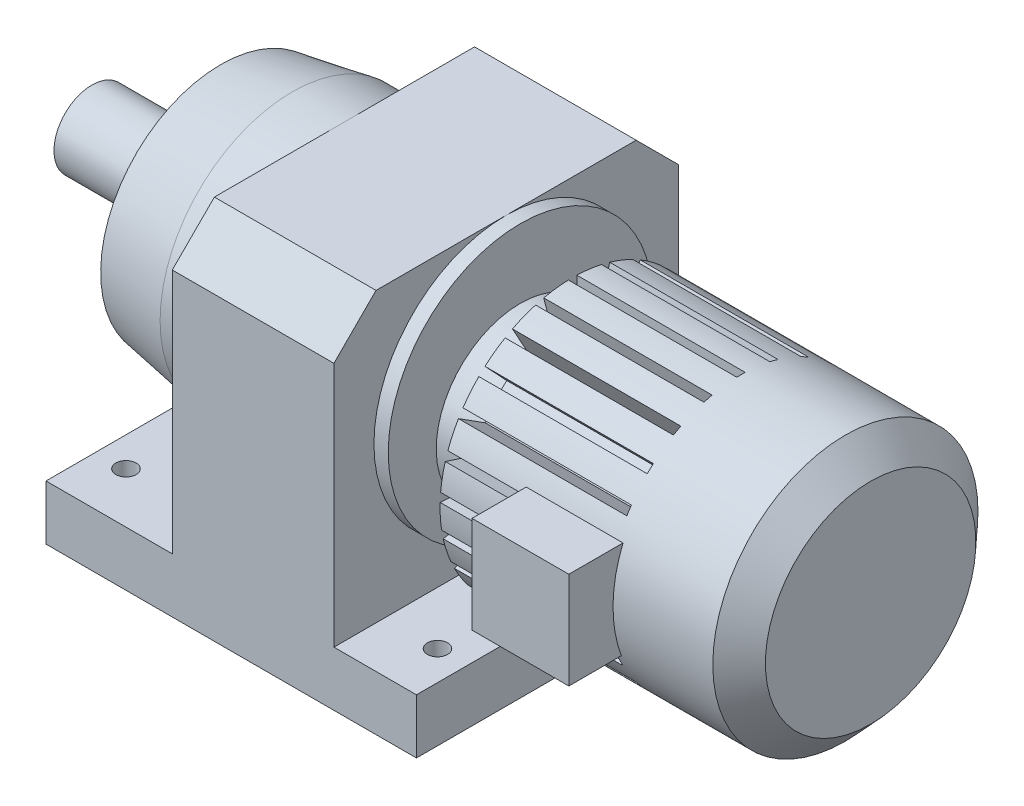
from build123d import *

# Parameters (mm, degrees)
BOSS_EXTRUDE1_DEPTH      = 204.5
SKETCH4_W                = 200
SKETCH4_H                = 37.822912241
CUT_EXTRUDE1_DEPTH       = 5
CIRPATTERN1_COUNT        = 25
CHAMFER1_SIZE            = 50
SKETCH5_R                = 12
CUT_EXTRUDE2_DEPTH       = 779.495147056
LPATTERN1_COUNT          = 2
LPATTERN1_PITCH          = 370
LPATTERN1_COUNT_DIR2     = 2
LPATTERN1_PITCH_DIR2     = 290
BOSS_EXTRUDE2_REACH      = 820.62
BOSS_EXTRUDE2_END_RADIUS = 157.5
SKETCH7_W                = 115
SKETCH7_H                = 115


with BuildPart() as part:
    # Sketch1 → Revolve1 (revolve)
    with BuildSketch(Plane.XY):
        Polygon((-256.217192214, 24.040666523), (-256.217192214, 69.040666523), (-113.217192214, 69.040666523), (-113.217192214, 139.040666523), (-103.217192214, 139.040666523), (-103.217192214, 166.591725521), (-18.217192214, 181.040666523), (252.782807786, 181.040666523), (252.782807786, 24.040666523), align=None)
    revolve(axis=Axis((252.782807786, 24.040666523, 0), (-1, 0, 0)))

    # Sketch2 → Revolve2 (revolve)
    with BuildSketch(Plane.XY):
        Polygon((252.782807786, -0.959333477), (252.782807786, 99.040666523), (314.782807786, 99.040666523), (314.782807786, 156.540666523), (638.782807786, 156.540666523), (668.782807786, 124.040666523), (668.782807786, -0.959333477), align=None)
    revolve(axis=Axis((668.782807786, -0.959333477, 0), (-1, 0, 0)))

    # Sketch3 → Boss-Extrude1 (add, symmetric)
    with BuildSketch(Plane.XY):
        Polygon((-106.217192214, -225.959333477), (333.782807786, -225.959333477), (333.782807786, -160.959333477), (235.782807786, -160.959333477), (235.782807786, 181.040666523), (43.782807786, 181.040666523), (43.782807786, -160.959333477), (-106.217192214, -160.959333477), align=None)
    extrude(amount=BOSS_EXTRUDE1_DEPTH, both=True)

    # Sketch4 → Cut-Extrude1 (cut, symmetric)
    with BuildSketch(Plane.XY):
        with Locations((414.782807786, 137.629210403)):
            Rectangle(SKETCH4_W, SKETCH4_H)
    cut_extrude1 = extrude(amount=CUT_EXTRUDE1_DEPTH, both=True, mode=Mode.SUBTRACT)

    # CirPattern1: Cut-Extrude1 ×25 about axis
    cirpattern1_axis = Axis((0, -0.959333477, 0), (1, 0, 0))
    for i in range(1, CIRPATTERN1_COUNT):
        add(cut_extrude1.rotate(cirpattern1_axis, i * 360 / CIRPATTERN1_COUNT), mode=Mode.SUBTRACT)

    # Chamfer1
    chamfer1_edges = [part.edges().sort_by_distance(p)[0] for p in [
        (139.782807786, 181.040666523, -204.5),
        (139.782807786, 181.040666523, 204.5),
    ]]
    chamfer(chamfer1_edges, length=CHAMFER1_SIZE)

    # Sketch5 → Cut-Extrude2 (cut, through all)
    with BuildSketch(Plane(origin=(0, -160.959333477, 0), x_dir=(1, 0, 0), z_dir=(0, 1, 0))):
        with Locations(Location((298.782807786, -144.5, 0), (0, 0, 270))):
            Circle(SKETCH5_R)
    cut_extrude2 = extrude(amount=-CUT_EXTRUDE2_DEPTH, mode=Mode.SUBTRACT)

    # LPattern1: Cut-Extrude2 2 × 2
    with Locations(*[(-i * LPATTERN1_PITCH, 0, -j * LPATTERN1_PITCH_DIR2) for i in range(LPATTERN1_COUNT) for j in range(LPATTERN1_COUNT_DIR2) if (i, j) != (0, 0)]):
        add(cut_extrude2, mode=Mode.SUBTRACT)

    # Boss-Extrude2: up to this cylinder (the profile starts outside it)
    boss_extrude2_end = Plane(origin=(462.782808, -0.959333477, 0), z_dir=(1, 0, 0)) * Cylinder(BOSS_EXTRUDE2_END_RADIUS, 1957.24, mode=Mode.PRIVATE)
    # Sketch7 → Boss-Extrude2 (add, up to the surface)
    with BuildSketch(Plane.XY.offset(210), mode=Mode.PRIVATE) as boss_extrude2_sk1:
        with Locations((462.782807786, 1.565119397)):
            Rectangle(SKETCH7_W, SKETCH7_H)
    boss_extrude2_tool1 = extrude(boss_extrude2_sk1.sketch, amount=-BOSS_EXTRUDE2_REACH, mode=Mode.PRIVATE) - boss_extrude2_end
    add(boss_extrude2_tool1.solids().sort_by_distance((462.782808, 1.565119, 210))[0])


solid = part.part
